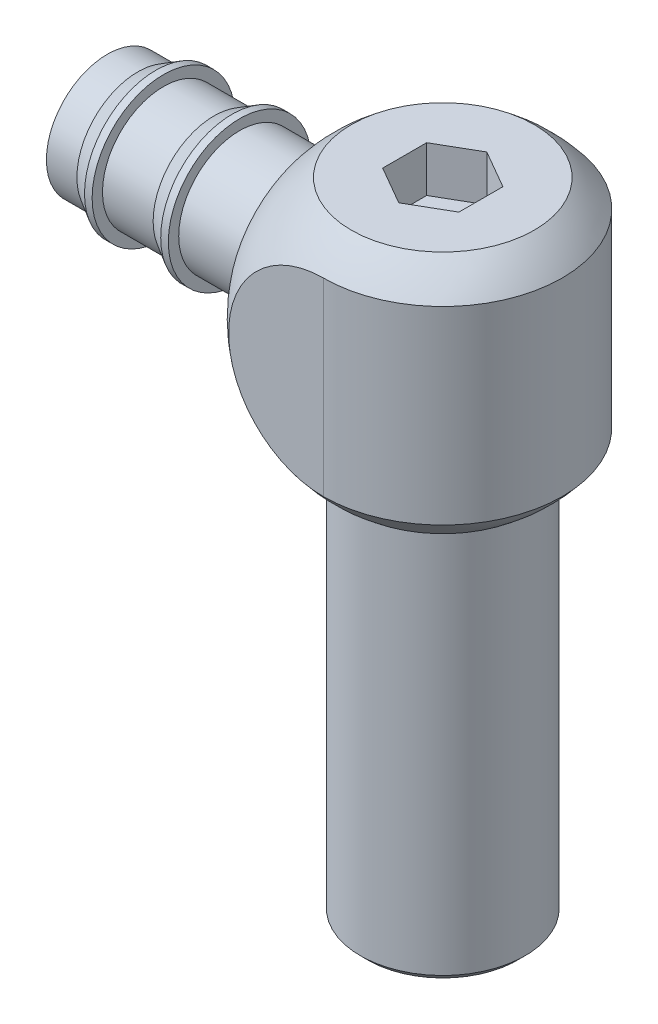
ISO-10303-21;
HEADER;
FILE_DESCRIPTION(('STEP AP214'),'2;1');
FILE_NAME('part.step','',(''),(''),'','','');
FILE_SCHEMA(('AUTOMOTIVE_DESIGN { 1 0 10303 214 1 1 1 1 }'));
ENDSEC;
DATA;
#1=APPLICATION_CONTEXT('core data for automotive mechanical design processes');
#2=APPLICATION_PROTOCOL_DEFINITION('international standard','automotive_design',2000,#1);
#3=PRODUCT_CONTEXT('',#1,'mechanical');
#4=PRODUCT('Part','Part','',(#3));
#5=PRODUCT_RELATED_PRODUCT_CATEGORY('part','',(#4));
#6=PRODUCT_DEFINITION_FORMATION('','',#4);
#7=PRODUCT_DEFINITION_CONTEXT('part definition',#1,'design');
#8=PRODUCT_DEFINITION('design','',#6,#7);
#9=PRODUCT_DEFINITION_SHAPE('','',#8);
#10=(LENGTH_UNIT() NAMED_UNIT(*) SI_UNIT(.MILLI.,.METRE.));
#11=(NAMED_UNIT(*) PLANE_ANGLE_UNIT() SI_UNIT($,.RADIAN.));
#12=(NAMED_UNIT(*) SI_UNIT($,.STERADIAN.) SOLID_ANGLE_UNIT());
#13=UNCERTAINTY_MEASURE_WITH_UNIT(LENGTH_MEASURE(1.E-05),#10,'distance_accuracy_value','');
#14=(GEOMETRIC_REPRESENTATION_CONTEXT(3) GLOBAL_UNCERTAINTY_ASSIGNED_CONTEXT((#13)) GLOBAL_UNIT_ASSIGNED_CONTEXT((#10,
#11,#12)) REPRESENTATION_CONTEXT('',''));
#15=CARTESIAN_POINT('',(0.,0.,0.));
#16=DIRECTION('',(0.,0.,1.));
#17=DIRECTION('',(1.,0.,0.));
#18=AXIS2_PLACEMENT_3D('',#15,#16,#17);
#19=CARTESIAN_POINT('',(-19.05,5.5626,-12.446));
#20=DIRECTION('',(0.,-1.,0.));
#21=DIRECTION('',(1.,0.,0.));
#22=AXIS2_PLACEMENT_3D('',#19,#20,#21);
#23=PLANE('',#22);
#24=CARTESIAN_POINT('',(0.,5.5626,0.));
#25=DIRECTION('',(0.,-1.,0.));
#26=DIRECTION('',(1.,0.,0.));
#27=AXIS2_PLACEMENT_3D('',#24,#25,#26);
#28=CIRCLE('',#27,9.525);
#29=CARTESIAN_POINT('',(9.525,5.5626,0.));
#30=VERTEX_POINT('',#29);
#31=EDGE_CURVE('E206',#30,#30,#28,.F.);
#32=ORIENTED_EDGE('',*,*,#31,.F.);
#33=EDGE_LOOP('',(#32));
#34=FACE_BOUND('',#33,.T.);
#35=CARTESIAN_POINT('',(0.,5.5626,0.));
#36=DIRECTION('',(0.,1.,0.));
#37=DIRECTION('',(-1.,0.,0.));
#38=AXIS2_PLACEMENT_3D('',#35,#36,#37);
#39=CIRCLE('',#38,8.57249999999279);
#40=CARTESIAN_POINT('',(-8.57249999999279,5.5626,0.));
#41=VERTEX_POINT('',#40);
#42=EDGE_CURVE('E160',#41,#41,#39,.T.);
#43=ORIENTED_EDGE('',*,*,#42,.T.);
#44=EDGE_LOOP('',(#43));
#45=FACE_BOUND('',#44,.T.);
#46=ADVANCED_FACE('F38',(#34,#45),#23,.T.);
#47=CARTESIAN_POINT('',(-12.446,2.3876,12.446));
#48=DIRECTION('',(1.,0.,0.));
#49=DIRECTION('',(0.,0.,-1.));
#50=AXIS2_PLACEMENT_3D('',#47,#48,#49);
#51=PLANE('',#50);
#52=CARTESIAN_POINT('',(-12.446,18.2626,0.));
#53=DIRECTION('',(1.,0.,0.));
#54=DIRECTION('',(0.,0.,-1.));
#55=AXIS2_PLACEMENT_3D('',#52,#53,#54);
#56=CIRCLE('',#55,7.9375);
#57=CARTESIAN_POINT('',(-12.446,18.2626,-7.9375));
#58=VERTEX_POINT('',#57);
#59=EDGE_CURVE('E12',#58,#58,#56,.T.);
#60=ORIENTED_EDGE('',*,*,#59,.T.);
#61=EDGE_LOOP('',(#60));
#62=FACE_BOUND('',#61,.T.);
#63=CARTESIAN_POINT('',(-12.446,18.2626,0.));
#64=DIRECTION('',(1.,0.,0.));
#65=DIRECTION('',(0.,0.,-1.));
#66=AXIS2_PLACEMENT_3D('',#63,#64,#65);
#67=CIRCLE('',#66,9.8545780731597);
#68=CARTESIAN_POINT('',(-12.446,18.2626,-9.8545780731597));
#69=VERTEX_POINT('',#68);
#70=EDGE_CURVE('E214',#69,#69,#67,.F.);
#71=ORIENTED_EDGE('',*,*,#70,.T.);
#72=EDGE_LOOP('',(#71));
#73=FACE_BOUND('',#72,.T.);
#74=ADVANCED_FACE('F250',(#62,#73),#51,.F.);
#75=CARTESIAN_POINT('',(0.,18.2626,0.));
#76=DIRECTION('',(0.,-1.,0.));
#77=DIRECTION('',(1.,0.,0.));
#78=AXIS2_PLACEMENT_3D('',#75,#76,#77);
#79=SPHERICAL_SURFACE('',#78,15.875);
#80=ORIENTED_EDGE('',*,*,#31,.T.);
#81=EDGE_LOOP('',(#80));
#82=FACE_BOUND('',#81,.T.);
#83=ORIENTED_EDGE('',*,*,#70,.F.);
#84=EDGE_LOOP('',(#83));
#85=FACE_BOUND('',#84,.T.);
#86=CARTESIAN_POINT('',(0.,18.2626,-12.446));
#87=DIRECTION('',(0.,0.,1.));
#88=DIRECTION('',(1.,0.,0.));
#89=AXIS2_PLACEMENT_3D('',#86,#87,#88);
#90=CIRCLE('',#89,9.8545780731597);
#91=CARTESIAN_POINT('',(0.,8.40802192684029,-12.446));
#92=VERTEX_POINT('',#91);
#93=CARTESIAN_POINT('',(0.,28.1171780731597,-12.446));
#94=VERTEX_POINT('',#93);
#95=EDGE_CURVE('E222',#92,#94,#90,.F.);
#96=ORIENTED_EDGE('',*,*,#95,.F.);
#97=CARTESIAN_POINT('',(0.,8.40802192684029,0.));
#98=DIRECTION('',(0.,1.,0.));
#99=DIRECTION('',(0.,0.,1.));
#100=AXIS2_PLACEMENT_3D('',#97,#98,#99);
#101=CIRCLE('',#100,12.446);
#102=CARTESIAN_POINT('',(0.,8.40802192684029,12.446));
#103=VERTEX_POINT('',#102);
#104=EDGE_CURVE('E220',#103,#92,#101,.T.);
#105=ORIENTED_EDGE('',*,*,#104,.F.);
#106=CARTESIAN_POINT('',(0.,18.2626,12.446));
#107=DIRECTION('',(0.,0.,-1.));
#108=DIRECTION('',(-1.,0.,0.));
#109=AXIS2_PLACEMENT_3D('',#106,#107,#108);
#110=CIRCLE('',#109,9.8545780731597);
#111=CARTESIAN_POINT('',(0.,28.1171780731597,12.446));
#112=VERTEX_POINT('',#111);
#113=EDGE_CURVE('E215',#112,#103,#110,.F.);
#114=ORIENTED_EDGE('',*,*,#113,.F.);
#115=CARTESIAN_POINT('',(0.,28.1171780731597,0.));
#116=DIRECTION('',(0.,-1.,0.));
#117=DIRECTION('',(0.,0.,-1.));
#118=AXIS2_PLACEMENT_3D('',#115,#116,#117);
#119=CIRCLE('',#118,12.446);
#120=EDGE_CURVE('E217',#94,#112,#119,.T.);
#121=ORIENTED_EDGE('',*,*,#120,.F.);
#122=EDGE_LOOP('',(#96,#105,#114,#121));
#123=FACE_BOUND('',#122,.T.);
#124=CARTESIAN_POINT('',(0.,30.9626,0.));
#125=DIRECTION('',(0.,1.,0.));
#126=DIRECTION('',(-1.,0.,0.));
#127=AXIS2_PLACEMENT_3D('',#124,#125,#126);
#128=CIRCLE('',#127,9.525);
#129=CARTESIAN_POINT('',(-9.525,30.9626,0.));
#130=VERTEX_POINT('',#129);
#131=EDGE_CURVE('E211',#130,#130,#128,.F.);
#132=ORIENTED_EDGE('',*,*,#131,.T.);
#133=EDGE_LOOP('',(#132));
#134=FACE_BOUND('',#133,.T.);
#135=ADVANCED_FACE('F256',(#82,#85,#123,#134),#79,.T.);
#136=CARTESIAN_POINT('',(0.,2.3876,-12.446));
#137=DIRECTION('',(0.,0.,1.));
#138=DIRECTION('',(1.,0.,0.));
#139=AXIS2_PLACEMENT_3D('',#136,#137,#138);
#140=PLANE('',#139);
#141=ORIENTED_EDGE('',*,*,#95,.T.);
#142=DIRECTION('',(0.,-1.,0.));
#143=VECTOR('',#142,1.);
#144=CARTESIAN_POINT('',(0.,2.3876,-12.446));
#145=LINE('',#144,#143);
#146=EDGE_CURVE('E210',#94,#92,#145,.T.);
#147=ORIENTED_EDGE('',*,*,#146,.T.);
#148=EDGE_LOOP('',(#141,#147));
#149=FACE_BOUND('',#148,.T.);
#150=ADVANCED_FACE('F268',(#149),#140,.F.);
#151=CARTESIAN_POINT('',(0.,2.3876,12.446));
#152=DIRECTION('',(0.,0.,-1.));
#153=DIRECTION('',(-1.,0.,0.));
#154=AXIS2_PLACEMENT_3D('',#151,#152,#153);
#155=PLANE('',#154);
#156=ORIENTED_EDGE('',*,*,#113,.T.);
#157=DIRECTION('',(0.,-1.,0.));
#158=VECTOR('',#157,1.);
#159=CARTESIAN_POINT('',(0.,2.3876,12.446));
#160=LINE('',#159,#158);
#161=EDGE_CURVE('E207',#112,#103,#160,.T.);
#162=ORIENTED_EDGE('',*,*,#161,.F.);
#163=EDGE_LOOP('',(#156,#162));
#164=FACE_BOUND('',#163,.T.);
#165=ADVANCED_FACE('F265',(#164),#155,.F.);
#166=CARTESIAN_POINT('',(0.,2.3876,0.));
#167=DIRECTION('',(0.,-1.,0.));
#168=DIRECTION('',(0.,0.,-1.));
#169=AXIS2_PLACEMENT_3D('',#166,#167,#168);
#170=CYLINDRICAL_SURFACE('',#169,12.446);
#171=ORIENTED_EDGE('',*,*,#104,.T.);
#172=ORIENTED_EDGE('',*,*,#146,.F.);
#173=ORIENTED_EDGE('',*,*,#120,.T.);
#174=ORIENTED_EDGE('',*,*,#161,.T.);
#175=EDGE_LOOP('',(#171,#172,#173,#174));
#176=FACE_BOUND('',#175,.T.);
#177=ADVANCED_FACE('F267',(#176),#170,.T.);
#178=CARTESIAN_POINT('',(-19.05,30.9626,-12.446));
#179=DIRECTION('',(0.,1.,0.));
#180=DIRECTION('',(-1.,0.,0.));
#181=AXIS2_PLACEMENT_3D('',#178,#179,#180);
#182=PLANE('',#181);
#183=DIRECTION('',(0.,0.,-1.));
#184=VECTOR('',#183,1.);
#185=CARTESIAN_POINT('',(3.96875000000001,30.9626,2.29135888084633));
#186=LINE('',#185,#184);
#187=CARTESIAN_POINT('',(3.96875000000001,30.9626,2.29135888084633));
#188=VERTEX_POINT('',#187);
#189=CARTESIAN_POINT('',(3.96875000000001,30.9626,-2.29135888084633));
#190=VERTEX_POINT('',#189);
#191=EDGE_CURVE('E59',#188,#190,#186,.T.);
#192=ORIENTED_EDGE('',*,*,#191,.F.);
#193=DIRECTION('',(0.866025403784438,0.,-0.5));
#194=VECTOR('',#193,1.);
#195=CARTESIAN_POINT('',(0.,30.9626,4.58271776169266));
#196=LINE('',#195,#194);
#197=CARTESIAN_POINT('',(0.,30.9626,4.58271776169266));
#198=VERTEX_POINT('',#197);
#199=EDGE_CURVE('E127',#198,#188,#196,.T.);
#200=ORIENTED_EDGE('',*,*,#199,.F.);
#201=DIRECTION('',(0.866025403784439,0.,0.5));
#202=VECTOR('',#201,1.);
#203=CARTESIAN_POINT('',(-3.96875,30.9626,2.29135888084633));
#204=LINE('',#203,#202);
#205=CARTESIAN_POINT('',(-3.96875,30.9626,2.29135888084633));
#206=VERTEX_POINT('',#205);
#207=EDGE_CURVE('E130',#206,#198,#204,.T.);
#208=ORIENTED_EDGE('',*,*,#207,.F.);
#209=DIRECTION('',(0.,0.,1.));
#210=VECTOR('',#209,1.);
#211=CARTESIAN_POINT('',(-3.96875,30.9626,-2.29135888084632));
#212=LINE('',#211,#210);
#213=CARTESIAN_POINT('',(-3.96875,30.9626,-2.29135888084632));
#214=VERTEX_POINT('',#213);
#215=EDGE_CURVE('E153',#214,#206,#212,.T.);
#216=ORIENTED_EDGE('',*,*,#215,.F.);
#217=DIRECTION('',(-0.866025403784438,0.,0.5));
#218=VECTOR('',#217,1.);
#219=CARTESIAN_POINT('',(0.,30.9626,-4.58271776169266));
#220=LINE('',#219,#218);
#221=CARTESIAN_POINT('',(0.,30.9626,-4.58271776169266));
#222=VERTEX_POINT('',#221);
#223=EDGE_CURVE('E150',#222,#214,#220,.T.);
#224=ORIENTED_EDGE('',*,*,#223,.F.);
#225=DIRECTION('',(-0.866025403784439,0.,-0.499999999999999));
#226=VECTOR('',#225,1.);
#227=CARTESIAN_POINT('',(3.96875000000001,30.9626,-2.29135888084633));
#228=LINE('',#227,#226);
#229=EDGE_CURVE('E148',#190,#222,#228,.T.);
#230=ORIENTED_EDGE('',*,*,#229,.F.);
#231=EDGE_LOOP('',(#192,#200,#208,#216,#224,#230));
#232=FACE_BOUND('',#231,.T.);
#233=ORIENTED_EDGE('',*,*,#131,.F.);
#234=EDGE_LOOP('',(#233));
#235=FACE_BOUND('',#234,.T.);
#236=ADVANCED_FACE('F263',(#232,#235),#182,.T.);
#237=CARTESIAN_POINT('',(0.,18.2626,0.));
#238=DIRECTION('',(-1.,0.,0.));
#239=DIRECTION('',(0.,0.,1.));
#240=AXIS2_PLACEMENT_3D('',#237,#238,#239);
#241=CYLINDRICAL_SURFACE('',#240,6.35);
#242=CARTESIAN_POINT('',(-14.0335,18.2626,0.));
#243=DIRECTION('',(1.,0.,0.));
#244=DIRECTION('',(0.,0.,-1.));
#245=AXIS2_PLACEMENT_3D('',#242,#243,#244);
#246=CIRCLE('',#245,6.35);
#247=CARTESIAN_POINT('',(-14.0335,18.2626,-6.35));
#248=VERTEX_POINT('',#247);
#249=EDGE_CURVE('E46',#248,#248,#246,.F.);
#250=ORIENTED_EDGE('',*,*,#249,.T.);
#251=EDGE_LOOP('',(#250));
#252=FACE_BOUND('',#251,.T.);
#253=CARTESIAN_POINT('',(-21.1490011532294,18.2626,0.));
#254=DIRECTION('',(-1.,0.,0.));
#255=DIRECTION('',(0.,0.,1.));
#256=AXIS2_PLACEMENT_3D('',#253,#254,#255);
#257=CIRCLE('',#256,6.35);
#258=CARTESIAN_POINT('',(-21.1490011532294,18.2626,6.35));
#259=VERTEX_POINT('',#258);
#260=EDGE_CURVE('E182',#259,#259,#257,.T.);
#261=ORIENTED_EDGE('',*,*,#260,.F.);
#262=EDGE_LOOP('',(#261));
#263=FACE_BOUND('',#262,.T.);
#264=ADVANCED_FACE('F232',(#252,#263),#241,.T.);
#265=CARTESIAN_POINT('',(0.,18.2626,0.));
#266=DIRECTION('',(-1.,0.,0.));
#267=DIRECTION('',(0.,0.,1.));
#268=AXIS2_PLACEMENT_3D('',#265,#266,#267);
#269=CYLINDRICAL_SURFACE('',#268,6.35);
#270=CARTESIAN_POINT('',(-34.925,18.2626,0.));
#271=DIRECTION('',(-1.,0.,0.));
#272=DIRECTION('',(0.,0.,1.));
#273=AXIS2_PLACEMENT_3D('',#270,#271,#272);
#274=CIRCLE('',#273,6.35);
#275=CARTESIAN_POINT('',(-34.925,18.2626,6.35));
#276=VERTEX_POINT('',#275);
#277=EDGE_CURVE('E179',#276,#276,#274,.T.);
#278=ORIENTED_EDGE('',*,*,#277,.F.);
#279=EDGE_LOOP('',(#278));
#280=FACE_BOUND('',#279,.T.);
#281=CARTESIAN_POINT('',(-31.75,18.2626,0.));
#282=DIRECTION('',(-1.,0.,0.));
#283=DIRECTION('',(0.,0.,1.));
#284=AXIS2_PLACEMENT_3D('',#281,#282,#283);
#285=CIRCLE('',#284,6.35);
#286=CARTESIAN_POINT('',(-31.75,18.2626,6.35));
#287=VERTEX_POINT('',#286);
#288=EDGE_CURVE('E203',#287,#287,#285,.T.);
#289=ORIENTED_EDGE('',*,*,#288,.T.);
#290=EDGE_LOOP('',(#289));
#291=FACE_BOUND('',#290,.T.);
#292=ADVANCED_FACE('F294',(#280,#291),#269,.T.);
#293=CARTESIAN_POINT('',(-29.8802511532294,18.2626,0.));
#294=DIRECTION('',(1.,0.,0.));
#295=DIRECTION('',(0.,0.,-1.));
#296=AXIS2_PLACEMENT_3D('',#293,#294,#295);
#297=CONICAL_SURFACE('',#296,7.4295,0.523598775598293);
#298=ORIENTED_EDGE('',*,*,#288,.F.);
#299=EDGE_LOOP('',(#298));
#300=FACE_BOUND('',#299,.T.);
#301=CARTESIAN_POINT('',(-29.8802511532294,18.2626,0.));
#302=DIRECTION('',(-1.,0.,0.));
#303=DIRECTION('',(0.,0.,1.));
#304=AXIS2_PLACEMENT_3D('',#301,#302,#303);
#305=CIRCLE('',#304,7.4295);
#306=CARTESIAN_POINT('',(-29.8802511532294,18.2626,7.4295));
#307=VERTEX_POINT('',#306);
#308=EDGE_CURVE('E200',#307,#307,#305,.T.);
#309=ORIENTED_EDGE('',*,*,#308,.T.);
#310=EDGE_LOOP('',(#309));
#311=FACE_BOUND('',#310,.T.);
#312=ADVANCED_FACE('F360',(#300,#311),#297,.T.);
#313=CARTESIAN_POINT('',(0.,18.2626,0.));
#314=DIRECTION('',(-1.,0.,0.));
#315=DIRECTION('',(0.,0.,1.));
#316=AXIS2_PLACEMENT_3D('',#313,#314,#315);
#317=CYLINDRICAL_SURFACE('',#316,7.4295);
#318=ORIENTED_EDGE('',*,*,#308,.F.);
#319=EDGE_LOOP('',(#318));
#320=FACE_BOUND('',#319,.T.);
#321=CARTESIAN_POINT('',(-29.0865011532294,18.2626,0.));
#322=DIRECTION('',(-1.,0.,0.));
#323=DIRECTION('',(0.,0.,1.));
#324=AXIS2_PLACEMENT_3D('',#321,#322,#323);
#325=CIRCLE('',#324,7.4295);
#326=CARTESIAN_POINT('',(-29.0865011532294,18.2626,7.4295));
#327=VERTEX_POINT('',#326);
#328=EDGE_CURVE('E197',#327,#327,#325,.T.);
#329=ORIENTED_EDGE('',*,*,#328,.T.);
#330=EDGE_LOOP('',(#329));
#331=FACE_BOUND('',#330,.T.);
#332=ADVANCED_FACE('F356',(#320,#331),#317,.T.);
#333=CARTESIAN_POINT('',(-29.0865011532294,18.2626,-7.4295));
#334=DIRECTION('',(-1.,0.,0.));
#335=DIRECTION('',(0.,0.,1.));
#336=AXIS2_PLACEMENT_3D('',#333,#334,#335);
#337=PLANE('',#336);
#338=ORIENTED_EDGE('',*,*,#328,.F.);
#339=EDGE_LOOP('',(#338));
#340=FACE_BOUND('',#339,.T.);
#341=CARTESIAN_POINT('',(-29.0865011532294,18.2626,0.));
#342=DIRECTION('',(-1.,0.,0.));
#343=DIRECTION('',(0.,0.,1.));
#344=AXIS2_PLACEMENT_3D('',#341,#342,#343);
#345=CIRCLE('',#344,6.35);
#346=CARTESIAN_POINT('',(-29.0865011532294,18.2626,6.35));
#347=VERTEX_POINT('',#346);
#348=EDGE_CURVE('E194',#347,#347,#345,.T.);
#349=ORIENTED_EDGE('',*,*,#348,.T.);
#350=EDGE_LOOP('',(#349));
#351=FACE_BOUND('',#350,.T.);
#352=ADVANCED_FACE('F352',(#340,#351),#337,.F.);
#353=CARTESIAN_POINT('',(0.,18.2626,0.));
#354=DIRECTION('',(-1.,0.,0.));
#355=DIRECTION('',(0.,0.,1.));
#356=AXIS2_PLACEMENT_3D('',#353,#354,#355);
#357=CYLINDRICAL_SURFACE('',#356,6.35);
#358=ORIENTED_EDGE('',*,*,#348,.F.);
#359=EDGE_LOOP('',(#358));
#360=FACE_BOUND('',#359,.T.);
#361=CARTESIAN_POINT('',(-23.8125,18.2626,0.));
#362=DIRECTION('',(-1.,0.,0.));
#363=DIRECTION('',(0.,0.,1.));
#364=AXIS2_PLACEMENT_3D('',#361,#362,#363);
#365=CIRCLE('',#364,6.35);
#366=CARTESIAN_POINT('',(-23.8125,18.2626,6.35));
#367=VERTEX_POINT('',#366);
#368=EDGE_CURVE('E191',#367,#367,#365,.T.);
#369=ORIENTED_EDGE('',*,*,#368,.T.);
#370=EDGE_LOOP('',(#369));
#371=FACE_BOUND('',#370,.T.);
#372=ADVANCED_FACE('F348',(#360,#371),#357,.T.);
#373=CARTESIAN_POINT('',(-21.9427511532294,18.2626,0.));
#374=DIRECTION('',(1.,0.,0.));
#375=DIRECTION('',(0.,0.,-1.));
#376=AXIS2_PLACEMENT_3D('',#373,#374,#375);
#377=CONICAL_SURFACE('',#376,7.4295,0.523598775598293);
#378=ORIENTED_EDGE('',*,*,#368,.F.);
#379=EDGE_LOOP('',(#378));
#380=FACE_BOUND('',#379,.T.);
#381=CARTESIAN_POINT('',(-21.9427511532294,18.2626,0.));
#382=DIRECTION('',(-1.,0.,0.));
#383=DIRECTION('',(0.,0.,1.));
#384=AXIS2_PLACEMENT_3D('',#381,#382,#383);
#385=CIRCLE('',#384,7.4295);
#386=CARTESIAN_POINT('',(-21.9427511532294,18.2626,7.4295));
#387=VERTEX_POINT('',#386);
#388=EDGE_CURVE('E188',#387,#387,#385,.T.);
#389=ORIENTED_EDGE('',*,*,#388,.T.);
#390=EDGE_LOOP('',(#389));
#391=FACE_BOUND('',#390,.T.);
#392=ADVANCED_FACE('F344',(#380,#391),#377,.T.);
#393=CARTESIAN_POINT('',(0.,18.2626,0.));
#394=DIRECTION('',(-1.,0.,0.));
#395=DIRECTION('',(0.,0.,1.));
#396=AXIS2_PLACEMENT_3D('',#393,#394,#395);
#397=CYLINDRICAL_SURFACE('',#396,7.4295);
#398=ORIENTED_EDGE('',*,*,#388,.F.);
#399=EDGE_LOOP('',(#398));
#400=FACE_BOUND('',#399,.T.);
#401=CARTESIAN_POINT('',(-21.1490011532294,18.2626,0.));
#402=DIRECTION('',(-1.,0.,0.));
#403=DIRECTION('',(0.,0.,1.));
#404=AXIS2_PLACEMENT_3D('',#401,#402,#403);
#405=CIRCLE('',#404,7.4295);
#406=CARTESIAN_POINT('',(-21.1490011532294,18.2626,7.4295));
#407=VERTEX_POINT('',#406);
#408=EDGE_CURVE('E185',#407,#407,#405,.T.);
#409=ORIENTED_EDGE('',*,*,#408,.T.);
#410=EDGE_LOOP('',(#409));
#411=FACE_BOUND('',#410,.T.);
#412=ADVANCED_FACE('F340',(#400,#411),#397,.T.);
#413=CARTESIAN_POINT('',(-21.1490011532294,18.2626,-7.4295));
#414=DIRECTION('',(-1.,0.,0.));
#415=DIRECTION('',(0.,0.,1.));
#416=AXIS2_PLACEMENT_3D('',#413,#414,#415);
#417=PLANE('',#416);
#418=ORIENTED_EDGE('',*,*,#408,.F.);
#419=EDGE_LOOP('',(#418));
#420=FACE_BOUND('',#419,.T.);
#421=ORIENTED_EDGE('',*,*,#260,.T.);
#422=EDGE_LOOP('',(#421));
#423=FACE_BOUND('',#422,.T.);
#424=ADVANCED_FACE('F245',(#420,#423),#417,.F.);
#425=CARTESIAN_POINT('',(-34.925,18.2626,0.));
#426=DIRECTION('',(1.,0.,0.));
#427=DIRECTION('',(0.,0.,-1.));
#428=AXIS2_PLACEMENT_3D('',#425,#426,#427);
#429=PLANE('',#428);
#430=CARTESIAN_POINT('',(-34.925,18.2626,0.));
#431=DIRECTION('',(-1.,0.,0.));
#432=DIRECTION('',(0.,0.,1.));
#433=AXIS2_PLACEMENT_3D('',#430,#431,#432);
#434=CIRCLE('',#433,5.08);
#435=CARTESIAN_POINT('',(-34.925,18.2626,5.08));
#436=VERTEX_POINT('',#435);
#437=EDGE_CURVE('E176',#436,#436,#434,.T.);
#438=ORIENTED_EDGE('',*,*,#437,.F.);
#439=EDGE_LOOP('',(#438));
#440=FACE_BOUND('',#439,.T.);
#441=ORIENTED_EDGE('',*,*,#277,.T.);
#442=EDGE_LOOP('',(#441));
#443=FACE_BOUND('',#442,.T.);
#444=ADVANCED_FACE('F237',(#440,#443),#429,.F.);
#445=CARTESIAN_POINT('',(-14.0335,18.2626,0.));
#446=DIRECTION('',(1.,0.,0.));
#447=DIRECTION('',(0.,0.,-1.));
#448=AXIS2_PLACEMENT_3D('',#445,#446,#447);
#449=TOROIDAL_SURFACE('',#448,7.9375,1.5875);
#450=ORIENTED_EDGE('',*,*,#59,.F.);
#451=EDGE_LOOP('',(#450));
#452=FACE_BOUND('',#451,.T.);
#453=ORIENTED_EDGE('',*,*,#249,.F.);
#454=EDGE_LOOP('',(#453));
#455=FACE_BOUND('',#454,.T.);
#456=ADVANCED_FACE('F40',(#452,#455),#449,.F.);
#457=CARTESIAN_POINT('',(14.3684097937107,18.2626,0.));
#458=DIRECTION('',(-1.,0.,0.));
#459=DIRECTION('',(0.,0.,1.));
#460=AXIS2_PLACEMENT_3D('',#457,#458,#459);
#461=CYLINDRICAL_SURFACE('',#460,5.08);
#462=CARTESIAN_POINT('',(-2.25066969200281,18.2626,5.08));
#463=CARTESIAN_POINT('',(-2.25065231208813,18.1899018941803,5.08000460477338));
#464=CARTESIAN_POINT('',(-2.25420953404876,18.1172390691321,5.07843544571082));
#465=CARTESIAN_POINT('',(-2.26812549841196,17.9726933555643,5.07223655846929));
#466=CARTESIAN_POINT('',(-2.27848570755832,17.9008106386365,5.06760617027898));
#467=CARTESIAN_POINT('',(-2.31892187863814,17.6868397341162,5.04929680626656));
#468=CARTESIAN_POINT('',(-2.35834723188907,17.54685632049,5.03120101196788));
#469=CARTESIAN_POINT('',(-2.44257486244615,17.3087001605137,4.99072451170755));
#470=CARTESIAN_POINT('',(-2.48365894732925,17.2087237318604,4.97049809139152));
#471=CARTESIAN_POINT('',(-2.57279944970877,17.0130624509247,4.92494958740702));
#472=CARTESIAN_POINT('',(-2.62086075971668,16.9173806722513,4.89962392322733));
#473=CARTESIAN_POINT('',(-2.72191918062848,16.7297572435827,4.84421304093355));
#474=CARTESIAN_POINT('',(-2.77493040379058,16.6378274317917,4.81411403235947));
#475=CARTESIAN_POINT('',(-2.88421161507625,16.4575282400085,4.74945056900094));
#476=CARTESIAN_POINT('',(-2.94048268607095,16.3691600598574,4.71488462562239));
#477=CARTESIAN_POINT('',(-3.10075532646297,16.1264888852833,4.61217251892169));
#478=CARTESIAN_POINT('',(-3.20707285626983,15.9757348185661,4.53920996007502));
#479=CARTESIAN_POINT('',(-3.42185799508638,15.6831865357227,4.379586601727));
#480=CARTESIAN_POINT('',(-3.53032703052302,15.5413985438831,4.2929164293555));
#481=CARTESIAN_POINT('',(-3.74622025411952,15.2666269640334,4.10586419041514));
#482=CARTESIAN_POINT('',(-3.85364552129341,15.1336332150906,4.00549837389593));
#483=CARTESIAN_POINT('',(-4.06505003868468,14.8766851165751,3.79077745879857));
#484=CARTESIAN_POINT('',(-4.16903108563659,14.7527260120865,3.6764298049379));
#485=CARTESIAN_POINT('',(-4.42189237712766,14.4551711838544,3.37267575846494));
#486=CARTESIAN_POINT('',(-4.5673223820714,14.2876268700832,3.17426357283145));
#487=CARTESIAN_POINT('',(-4.83747764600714,13.9799580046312,2.74497565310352));
#488=CARTESIAN_POINT('',(-4.9622389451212,13.8397856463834,2.51415775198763));
#489=CARTESIAN_POINT('',(-5.16031205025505,13.6187662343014,2.07110165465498));
#490=CARTESIAN_POINT('',(-5.238924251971,13.5316589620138,1.86442813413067));
#491=CARTESIAN_POINT('',(-5.33913101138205,13.4210046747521,1.54217514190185));
#492=CARTESIAN_POINT('',(-5.36958739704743,13.3874477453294,1.43268459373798));
#493=CARTESIAN_POINT('',(-5.4240570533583,13.3275175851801,1.21021074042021));
#494=CARTESIAN_POINT('',(-5.44807312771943,13.3011412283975,1.09722897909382));
#495=CARTESIAN_POINT('',(-5.48932161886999,13.2558820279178,0.867727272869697));
#496=CARTESIAN_POINT('',(-5.50650673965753,13.2370514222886,0.751188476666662));
#497=CARTESIAN_POINT('',(-5.53347988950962,13.2075112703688,0.516230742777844));
#498=CARTESIAN_POINT('',(-5.54326789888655,13.1968017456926,0.397811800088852));
#499=CARTESIAN_POINT('',(-5.55521469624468,13.1837316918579,0.16016700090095));
#500=CARTESIAN_POINT('',(-5.55737595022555,13.1813684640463,0.0409414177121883));
#501=CARTESIAN_POINT('',(-5.55402446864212,13.1850342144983,-0.197264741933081));
#502=CARTESIAN_POINT('',(-5.54851233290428,13.1910625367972,-0.316245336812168));
#503=CARTESIAN_POINT('',(-5.53092027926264,13.210315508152,-0.540483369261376));
#504=CARTESIAN_POINT('',(-5.51958966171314,13.2227192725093,-0.64587156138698));
#505=CARTESIAN_POINT('',(-5.49110125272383,13.2539356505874,-0.854908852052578));
#506=CARTESIAN_POINT('',(-5.47394155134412,13.2727503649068,-0.958557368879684));
#507=CARTESIAN_POINT('',(-5.41414626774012,13.3383944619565,-1.26584328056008));
#508=CARTESIAN_POINT('',(-5.36317971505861,13.3944398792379,-1.46600080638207));
#509=CARTESIAN_POINT('',(-5.23937804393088,13.5311675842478,-1.86168961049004));
#510=CARTESIAN_POINT('',(-5.1656346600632,13.6128760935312,-2.05657083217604));
#511=CARTESIAN_POINT('',(-5.00133155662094,13.7961215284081,-2.42901210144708));
#512=CARTESIAN_POINT('',(-4.91076493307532,13.8976665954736,-2.60656499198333));
#513=CARTESIAN_POINT('',(-4.66542973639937,14.1751802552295,-3.03210005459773));
#514=CARTESIAN_POINT('',(-4.50195775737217,14.3621909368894,-3.26796893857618));
#515=CARTESIAN_POINT('',(-4.24332036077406,14.6649656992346,-3.58960480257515));
#516=CARTESIAN_POINT('',(-4.1546717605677,14.7698411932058,-3.69163348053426));
#517=CARTESIAN_POINT('',(-3.97428355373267,14.9864698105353,-3.88515619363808));
#518=CARTESIAN_POINT('',(-3.88254455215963,15.0982215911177,-3.97665227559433));
#519=CARTESIAN_POINT('',(-3.69521787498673,15.3310428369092,-4.15139687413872));
#520=CARTESIAN_POINT('',(-3.5995910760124,15.4522741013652,-4.23438642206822));
#521=CARTESIAN_POINT('',(-3.40847458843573,15.7016199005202,-4.38968870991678));
#522=CARTESIAN_POINT('',(-3.31298498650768,15.8297376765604,-4.46199636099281));
#523=CARTESIAN_POINT('',(-3.1248377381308,16.0929081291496,-4.59571278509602));
#524=CARTESIAN_POINT('',(-3.03217294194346,16.2279404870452,-4.65715136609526));
#525=CARTESIAN_POINT('',(-2.8529046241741,16.506206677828,-4.76906305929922));
#526=CARTESIAN_POINT('',(-2.76629444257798,16.6494311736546,-4.81954835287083));
#527=CARTESIAN_POINT('',(-2.61669125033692,16.9236800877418,-4.90214433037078));
#528=CARTESIAN_POINT('',(-2.5521031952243,17.0533278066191,-4.93587360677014));
#529=CARTESIAN_POINT('',(-2.43684265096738,17.320703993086,-4.99378276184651));
#530=CARTESIAN_POINT('',(-2.38614375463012,17.4584165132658,-5.01798080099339));
#531=CARTESIAN_POINT('',(-2.31298103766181,17.7176064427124,-5.05206999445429));
#532=CARTESIAN_POINT('',(-2.28718708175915,17.8378767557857,-5.06369143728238));
#533=CARTESIAN_POINT('',(-2.25474759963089,18.0814232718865,-5.07822581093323));
#534=CARTESIAN_POINT('',(-2.24806603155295,18.2046933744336,-5.08115513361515));
#535=CARTESIAN_POINT('',(-2.25515229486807,18.4505800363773,-5.0780122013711));
#536=CARTESIAN_POINT('',(-2.2689359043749,18.5731960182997,-5.07193300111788));
#537=CARTESIAN_POINT('',(-2.31428214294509,18.8144608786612,-5.05139492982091));
#538=CARTESIAN_POINT('',(-2.34588389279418,18.9331004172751,-5.0369176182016));
#539=CARTESIAN_POINT('',(-2.41571981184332,19.1448875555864,-5.00374181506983));
#540=CARTESIAN_POINT('',(-2.45189807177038,19.2389271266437,-4.9861872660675));
#541=CARTESIAN_POINT('',(-2.53092862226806,19.4232112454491,-4.94654118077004));
#542=CARTESIAN_POINT('',(-2.57378606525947,19.5134527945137,-4.9244461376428));
#543=CARTESIAN_POINT('',(-2.66439995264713,19.6906530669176,-4.87601627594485));
#544=CARTESIAN_POINT('',(-2.71217336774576,19.7775988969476,-4.8496665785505));
#545=CARTESIAN_POINT('',(-2.81107178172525,19.9482542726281,-4.79302076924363));
#546=CARTESIAN_POINT('',(-2.86219801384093,20.0319626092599,-4.76272320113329));
#547=CARTESIAN_POINT('',(-3.01322494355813,20.2697222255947,-4.66966758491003));
#548=CARTESIAN_POINT('',(-3.11602063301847,20.4200413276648,-4.60202715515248));
#549=CARTESIAN_POINT('',(-3.32474690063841,20.7118310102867,-4.45358822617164));
#550=CARTESIAN_POINT('',(-3.43067983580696,20.8532946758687,-4.3727796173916));
#551=CARTESIAN_POINT('',(-3.64242205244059,21.1277933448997,-4.19803632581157));
#552=CARTESIAN_POINT('',(-3.74823136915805,21.2608339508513,-4.10411050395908));
#553=CARTESIAN_POINT('',(-3.95731360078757,21.5184340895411,-3.90290098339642));
#554=CARTESIAN_POINT('',(-4.0605877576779,21.6429978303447,-3.79562398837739));
#555=CARTESIAN_POINT('',(-4.24153483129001,21.8581158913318,-3.59108162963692));
#556=CARTESIAN_POINT('',(-4.32007132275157,21.950361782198,-3.49636196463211));
#557=CARTESIAN_POINT('',(-4.47318008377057,22.1285931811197,-3.29822308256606));
#558=CARTESIAN_POINT('',(-4.54775143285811,22.2145772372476,-3.1948018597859));
#559=CARTESIAN_POINT('',(-4.76360727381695,22.4617569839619,-2.87172955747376));
#560=CARTESIAN_POINT('',(-4.89748474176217,22.6127099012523,-2.63877452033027));
#561=CARTESIAN_POINT('',(-5.10959941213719,22.8500437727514,-2.19336109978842));
#562=CARTESIAN_POINT('',(-5.19360802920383,22.9433291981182,-1.98736913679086));
#563=CARTESIAN_POINT('',(-5.30208400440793,23.0633155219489,-1.6651450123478));
#564=CARTESIAN_POINT('',(-5.33532698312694,23.099995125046,-1.55549698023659));
#565=CARTESIAN_POINT('',(-5.39537516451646,23.1661448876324,-1.33235476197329));
#566=CARTESIAN_POINT('',(-5.42218320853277,23.1956182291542,-1.21886229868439));
#567=CARTESIAN_POINT('',(-5.46900493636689,23.2470372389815,-0.987872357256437));
#568=CARTESIAN_POINT('',(-5.48896608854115,23.268924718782,-0.870351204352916));
#569=CARTESIAN_POINT('',(-5.52136955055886,23.3044310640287,-0.633033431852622));
#570=CARTESIAN_POINT('',(-5.533811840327,23.3180499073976,-0.513236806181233));
#571=CARTESIAN_POINT('',(-5.55087649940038,23.3367235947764,-0.272473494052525));
#572=CARTESIAN_POINT('',(-5.55550227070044,23.3417821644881,-0.151507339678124));
#573=CARTESIAN_POINT('',(-5.55683033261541,23.3432347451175,0.0905125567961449));
#574=CARTESIAN_POINT('',(-5.5535333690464,23.339629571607,0.211566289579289));
#575=CARTESIAN_POINT('',(-5.53992709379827,23.324742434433,0.438805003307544));
#576=CARTESIAN_POINT('',(-5.53046523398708,23.3143881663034,0.545103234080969));
#577=CARTESIAN_POINT('',(-5.50558294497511,23.2871357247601,0.756164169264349));
#578=CARTESIAN_POINT('',(-5.4901605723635,23.270235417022,0.860926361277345));
#579=CARTESIAN_POINT('',(-5.43534254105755,23.210095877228,1.17179768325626));
#580=CARTESIAN_POINT('',(-5.38738371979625,23.1574047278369,1.37468483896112));
#581=CARTESIAN_POINT('',(-5.26986084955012,23.0277541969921,1.77346452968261));
#582=CARTESIAN_POINT('',(-5.19965286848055,22.9500702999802,1.96892367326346));
#583=CARTESIAN_POINT('',(-5.04211698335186,22.7746836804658,2.34312996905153));
#584=CARTESIAN_POINT('',(-4.95478103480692,22.6769715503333,2.52186920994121));
#585=CARTESIAN_POINT('',(-4.71845670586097,22.4103651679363,2.94859273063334));
#586=CARTESIAN_POINT('',(-4.56081015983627,22.2306541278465,3.18512067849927));
#587=CARTESIAN_POINT('',(-4.31038868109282,21.939063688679,3.50873801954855));
#588=CARTESIAN_POINT('',(-4.22442120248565,21.837993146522,3.61157246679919));
#589=CARTESIAN_POINT('',(-4.04913300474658,21.6290828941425,3.80704984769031));
#590=CARTESIAN_POINT('',(-3.95981283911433,21.5212442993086,3.89969445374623));
#591=CARTESIAN_POINT('',(-3.77708390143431,21.2966115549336,4.0770275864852));
#592=CARTESIAN_POINT('',(-3.68362842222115,21.1796651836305,4.1614737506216));
#593=CARTESIAN_POINT('',(-3.49629548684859,20.9392143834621,4.32005611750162));
#594=CARTESIAN_POINT('',(-3.4024178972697,20.815707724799,4.39418878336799));
#595=CARTESIAN_POINT('',(-3.21647389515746,20.5620866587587,4.53206058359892));
#596=CARTESIAN_POINT('',(-3.12440474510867,20.4319835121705,4.59581669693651));
#597=CARTESIAN_POINT('',(-2.94481660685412,20.1642595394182,4.71290010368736));
#598=CARTESIAN_POINT('',(-2.85729407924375,20.0266447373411,4.76623560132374));
#599=CARTESIAN_POINT('',(-2.69354049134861,19.7465879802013,4.86059673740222));
#600=CARTESIAN_POINT('',(-2.61705412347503,19.6044047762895,4.90193667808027));
#601=CARTESIAN_POINT('',(-2.47912442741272,19.3101423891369,4.97311372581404));
#602=CARTESIAN_POINT('',(-2.41764993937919,19.1580845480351,5.00297473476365));
#603=CARTESIAN_POINT('',(-2.33167186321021,18.8821629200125,5.04350452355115));
#604=CARTESIAN_POINT('',(-2.30180974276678,18.7604567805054,5.05707679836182));
#605=CARTESIAN_POINT('',(-2.2613502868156,18.5133246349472,5.07530823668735));
#606=CARTESIAN_POINT('',(-2.25069964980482,18.3879099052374,5.0799920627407));
#607=CARTESIAN_POINT('',(-2.25066969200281,18.2626,5.08));
#608=B_SPLINE_CURVE_WITH_KNOTS('',3,(#462,#463,#464,#465,#466,#467,#468,#469,#470,#471,#472,
#473,#474,#475,#476,#477,#478,#479,#480,#481,#482,#483,#484,#485,#486,#487,#488,#489,#490,#491,
#492,#493,#494,#495,#496,#497,#498,#499,#500,#501,#502,#503,#504,#505,#506,#507,#508,#509,#510,
#511,#512,#513,#514,#515,#516,#517,#518,#519,#520,#521,#522,#523,#524,#525,#526,#527,#528,#529,
#530,#531,#532,#533,#534,#535,#536,#537,#538,#539,#540,#541,#542,#543,#544,#545,#546,#547,#548,
#549,#550,#551,#552,#553,#554,#555,#556,#557,#558,#559,#560,#561,#562,#563,#564,#565,#566,#567,
#568,#569,#570,#571,#572,#573,#574,#575,#576,#577,#578,#579,#580,#581,#582,#583,#584,#585,#586,
#587,#588,#589,#590,#591,#592,#593,#594,#595,#596,#597,#598,#599,#600,#601,#602,#603,#604,#605,
#606,#607),.UNSPECIFIED.,.T.,.F.,(4,2,2,2,2,2,2,2,2,2,2,2,2,2,2,2,2,2,2,2,2,2,2,2,2,2,2,2,2,2,2,
2,2,2,2,2,2,2,2,2,2,2,2,2,2,2,2,2,2,2,2,2,2,2,2,2,2,2,2,2,2,2,2,2,2,2,2,2,2,2,2,2,4),(0.,
0.217928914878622,0.43590483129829,0.873116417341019,1.20260456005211,1.53232486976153,
1.8630157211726,2.19381705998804,2.78812001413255,3.38283110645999,3.97684260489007,
4.57053918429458,5.46012243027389,6.3481377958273,7.05797447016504,7.41309209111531,
7.76805486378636,8.12543421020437,8.48281450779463,8.84007924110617,9.19731604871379,
9.51709331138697,9.83697545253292,10.4762029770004,11.14521354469,11.8144992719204,
12.8360274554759,13.3489234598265,13.861719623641,14.387159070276,14.9128480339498,
15.4370721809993,15.9607103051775,16.4060729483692,16.8505828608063,17.2197128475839,
17.5881462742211,17.9568639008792,18.3263942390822,18.6327836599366,18.939410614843,
19.2471340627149,19.5549713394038,20.1369090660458,20.7192956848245,21.3012907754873,
21.8829948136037,22.3439250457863,22.8049618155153,23.7244992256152,24.4451305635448,
24.8056568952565,25.1660237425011,25.5290966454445,25.8921705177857,26.2550863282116,
26.6179679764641,26.939238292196,27.2606134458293,27.902788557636,28.5655713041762,
29.2286660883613,30.2315820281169,30.7348658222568,31.2380668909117,31.7532657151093,
32.2686407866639,32.7831638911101,33.2972802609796,33.7963659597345,34.2944067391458,
34.6710980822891,35.0467426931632),.UNSPECIFIED.);
#609=CARTESIAN_POINT('',(-5.55625000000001,23.3426,0.));
#610=VERTEX_POINT('',#609);
#611=EDGE_CURVE('E133',#610,#610,#608,.T.);
#612=ORIENTED_EDGE('',*,*,#611,.T.);
#613=EDGE_LOOP('',(#612));
#614=FACE_BOUND('',#613,.T.);
#615=ORIENTED_EDGE('',*,*,#437,.T.);
#616=EDGE_LOOP('',(#615));
#617=FACE_BOUND('',#616,.T.);
#618=ADVANCED_FACE('F236',(#614,#617),#461,.F.);
#619=CARTESIAN_POINT('',(0.,-35.7124,0.));
#620=DIRECTION('',(0.,1.,0.));
#621=DIRECTION('',(-1.,0.,0.));
#622=AXIS2_PLACEMENT_3D('',#619,#620,#621);
#623=CONICAL_SURFACE('',#622,7.81049999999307,0.785398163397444);
#624=CARTESIAN_POINT('',(0.,-34.9504,0.));
#625=DIRECTION('',(0.,1.,0.));
#626=DIRECTION('',(-1.,0.,0.));
#627=AXIS2_PLACEMENT_3D('',#624,#625,#626);
#628=CIRCLE('',#627,8.57249999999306);
#629=CARTESIAN_POINT('',(-8.57249999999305,-34.9504,0.));
#630=VERTEX_POINT('',#629);
#631=EDGE_CURVE('E173',#630,#630,#628,.T.);
#632=ORIENTED_EDGE('',*,*,#631,.F.);
#633=EDGE_LOOP('',(#632));
#634=FACE_BOUND('',#633,.T.);
#635=CARTESIAN_POINT('',(0.,-35.7124,0.));
#636=DIRECTION('',(0.,1.,0.));
#637=DIRECTION('',(-1.,0.,0.));
#638=AXIS2_PLACEMENT_3D('',#635,#636,#637);
#639=CIRCLE('',#638,7.81049999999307);
#640=CARTESIAN_POINT('',(-7.81049999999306,-35.7124,0.));
#641=VERTEX_POINT('',#640);
#642=EDGE_CURVE('E170',#641,#641,#639,.T.);
#643=ORIENTED_EDGE('',*,*,#642,.T.);
#644=EDGE_LOOP('',(#643));
#645=FACE_BOUND('',#644,.T.);
#646=ADVANCED_FACE('F243',(#634,#645),#623,.T.);
#647=CARTESIAN_POINT('',(0.,-35.7124,0.));
#648=DIRECTION('',(0.,1.,0.));
#649=DIRECTION('',(-1.,0.,0.));
#650=AXIS2_PLACEMENT_3D('',#647,#648,#649);
#651=PLANE('',#650);
#652=CARTESIAN_POINT('',(0.,-35.7124,0.));
#653=DIRECTION('',(0.,-1.,0.));
#654=DIRECTION('',(1.,0.,0.));
#655=AXIS2_PLACEMENT_3D('',#652,#653,#654);
#656=CIRCLE('',#655,5.55625);
#657=CARTESIAN_POINT('',(5.55625,-35.7124,0.));
#658=VERTEX_POINT('',#657);
#659=EDGE_CURVE('E603',#658,#658,#656,.T.);
#660=ORIENTED_EDGE('',*,*,#659,.F.);
#661=EDGE_LOOP('',(#660));
#662=FACE_BOUND('',#661,.T.);
#663=ORIENTED_EDGE('',*,*,#642,.F.);
#664=EDGE_LOOP('',(#663));
#665=FACE_BOUND('',#664,.T.);
#666=ADVANCED_FACE('F329',(#662,#665),#651,.F.);
#667=CARTESIAN_POINT('',(0.,-10.6033932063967,0.));
#668=DIRECTION('',(0.,1.,0.));
#669=DIRECTION('',(-1.,0.,0.));
#670=AXIS2_PLACEMENT_3D('',#667,#668,#669);
#671=CYLINDRICAL_SURFACE('',#670,8.57249999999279);
#672=ORIENTED_EDGE('',*,*,#42,.F.);
#673=EDGE_LOOP('',(#672));
#674=FACE_BOUND('',#673,.T.);
#675=ORIENTED_EDGE('',*,*,#631,.T.);
#676=EDGE_LOOP('',(#675));
#677=FACE_BOUND('',#676,.T.);
#678=ADVANCED_FACE('F317',(#674,#677),#671,.T.);
#679=CARTESIAN_POINT('',(3.96875000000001,26.2001,2.29135888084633));
#680=DIRECTION('',(1.,0.,0.));
#681=DIRECTION('',(0.,0.,-1.));
#682=AXIS2_PLACEMENT_3D('',#679,#680,#681);
#683=PLANE('',#682);
#684=ORIENTED_EDGE('',*,*,#191,.T.);
#685=DIRECTION('',(0.,1.,0.));
#686=VECTOR('',#685,1.);
#687=CARTESIAN_POINT('',(3.96875000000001,26.2001,-2.29135888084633));
#688=LINE('',#687,#686);
#689=CARTESIAN_POINT('',(3.96875000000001,26.2001,-2.29135888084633));
#690=VERTEX_POINT('',#689);
#691=EDGE_CURVE('E104',#690,#190,#688,.T.);
#692=ORIENTED_EDGE('',*,*,#691,.F.);
#693=DIRECTION('',(0.,0.,-1.));
#694=VECTOR('',#693,1.);
#695=CARTESIAN_POINT('',(3.96875000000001,26.2001,2.29135888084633));
#696=LINE('',#695,#694);
#697=CARTESIAN_POINT('',(3.96875000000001,26.2001,2.29135888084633));
#698=VERTEX_POINT('',#697);
#699=EDGE_CURVE('E108',#698,#690,#696,.T.);
#700=ORIENTED_EDGE('',*,*,#699,.F.);
#701=DIRECTION('',(0.,1.,0.));
#702=VECTOR('',#701,1.);
#703=CARTESIAN_POINT('',(3.96875000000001,26.2001,2.29135888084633));
#704=LINE('',#703,#702);
#705=EDGE_CURVE('E158',#698,#188,#704,.T.);
#706=ORIENTED_EDGE('',*,*,#705,.T.);
#707=EDGE_LOOP('',(#684,#692,#700,#706));
#708=FACE_BOUND('',#707,.T.);
#709=ADVANCED_FACE('F106',(#708),#683,.F.);
#710=CARTESIAN_POINT('',(0.,26.2001,4.58271776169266));
#711=DIRECTION('',(0.5,0.,0.866025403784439));
#712=DIRECTION('',(0.866025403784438,0.,-0.5));
#713=AXIS2_PLACEMENT_3D('',#710,#711,#712);
#714=PLANE('',#713);
#715=ORIENTED_EDGE('',*,*,#199,.T.);
#716=ORIENTED_EDGE('',*,*,#705,.F.);
#717=DIRECTION('',(0.866025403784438,0.,-0.5));
#718=VECTOR('',#717,1.);
#719=CARTESIAN_POINT('',(0.,26.2001,4.58271776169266));
#720=LINE('',#719,#718);
#721=CARTESIAN_POINT('',(0.,26.2001,4.58271776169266));
#722=VERTEX_POINT('',#721);
#723=EDGE_CURVE('E114',#722,#698,#720,.T.);
#724=ORIENTED_EDGE('',*,*,#723,.F.);
#725=DIRECTION('',(0.,1.,0.));
#726=VECTOR('',#725,1.);
#727=CARTESIAN_POINT('',(0.,26.2001,4.58271776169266));
#728=LINE('',#727,#726);
#729=EDGE_CURVE('E161',#722,#198,#728,.T.);
#730=ORIENTED_EDGE('',*,*,#729,.T.);
#731=EDGE_LOOP('',(#715,#716,#724,#730));
#732=FACE_BOUND('',#731,.T.);
#733=ADVANCED_FACE('F309',(#732),#714,.F.);
#734=CARTESIAN_POINT('',(-3.96875,26.2001,2.29135888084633));
#735=DIRECTION('',(-0.5,0.,0.866025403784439));
#736=DIRECTION('',(0.866025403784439,0.,0.5));
#737=AXIS2_PLACEMENT_3D('',#734,#735,#736);
#738=PLANE('',#737);
#739=ORIENTED_EDGE('',*,*,#207,.T.);
#740=ORIENTED_EDGE('',*,*,#729,.F.);
#741=DIRECTION('',(0.866025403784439,0.,0.5));
#742=VECTOR('',#741,1.);
#743=CARTESIAN_POINT('',(-3.96875,26.2001,2.29135888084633));
#744=LINE('',#743,#742);
#745=CARTESIAN_POINT('',(-3.96875,26.2001,2.29135888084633));
#746=VERTEX_POINT('',#745);
#747=EDGE_CURVE('E144',#746,#722,#744,.T.);
#748=ORIENTED_EDGE('',*,*,#747,.F.);
#749=DIRECTION('',(0.,1.,0.));
#750=VECTOR('',#749,1.);
#751=CARTESIAN_POINT('',(-3.96875,26.2001,2.29135888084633));
#752=LINE('',#751,#750);
#753=EDGE_CURVE('E163',#746,#206,#752,.T.);
#754=ORIENTED_EDGE('',*,*,#753,.T.);
#755=EDGE_LOOP('',(#739,#740,#748,#754));
#756=FACE_BOUND('',#755,.T.);
#757=ADVANCED_FACE('F307',(#756),#738,.F.);
#758=CARTESIAN_POINT('',(-3.96875,26.2001,-2.29135888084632));
#759=DIRECTION('',(-1.,0.,0.));
#760=DIRECTION('',(0.,0.,1.));
#761=AXIS2_PLACEMENT_3D('',#758,#759,#760);
#762=PLANE('',#761);
#763=ORIENTED_EDGE('',*,*,#215,.T.);
#764=ORIENTED_EDGE('',*,*,#753,.F.);
#765=DIRECTION('',(0.,0.,1.));
#766=VECTOR('',#765,1.);
#767=CARTESIAN_POINT('',(-3.96875,26.2001,-2.29135888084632));
#768=LINE('',#767,#766);
#769=CARTESIAN_POINT('',(-3.96875,26.2001,-2.29135888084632));
#770=VERTEX_POINT('',#769);
#771=EDGE_CURVE('E141',#770,#746,#768,.T.);
#772=ORIENTED_EDGE('',*,*,#771,.F.);
#773=DIRECTION('',(0.,1.,0.));
#774=VECTOR('',#773,1.);
#775=CARTESIAN_POINT('',(-3.96875,26.2001,-2.29135888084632));
#776=LINE('',#775,#774);
#777=EDGE_CURVE('E165',#770,#214,#776,.T.);
#778=ORIENTED_EDGE('',*,*,#777,.T.);
#779=EDGE_LOOP('',(#763,#764,#772,#778));
#780=FACE_BOUND('',#779,.T.);
#781=ADVANCED_FACE('F305',(#780),#762,.F.);
#782=CARTESIAN_POINT('',(0.,26.2001,-4.58271776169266));
#783=DIRECTION('',(-0.5,0.,-0.866025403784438));
#784=DIRECTION('',(-0.866025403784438,0.,0.5));
#785=AXIS2_PLACEMENT_3D('',#782,#783,#784);
#786=PLANE('',#785);
#787=ORIENTED_EDGE('',*,*,#223,.T.);
#788=ORIENTED_EDGE('',*,*,#777,.F.);
#789=DIRECTION('',(-0.866025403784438,0.,0.5));
#790=VECTOR('',#789,1.);
#791=CARTESIAN_POINT('',(0.,26.2001,-4.58271776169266));
#792=LINE('',#791,#790);
#793=CARTESIAN_POINT('',(0.,26.2001,-4.58271776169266));
#794=VERTEX_POINT('',#793);
#795=EDGE_CURVE('E122',#794,#770,#792,.T.);
#796=ORIENTED_EDGE('',*,*,#795,.F.);
#797=DIRECTION('',(0.,1.,0.));
#798=VECTOR('',#797,1.);
#799=CARTESIAN_POINT('',(0.,26.2001,-4.58271776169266));
#800=LINE('',#799,#798);
#801=EDGE_CURVE('E113',#794,#222,#800,.T.);
#802=ORIENTED_EDGE('',*,*,#801,.T.);
#803=EDGE_LOOP('',(#787,#788,#796,#802));
#804=FACE_BOUND('',#803,.T.);
#805=ADVANCED_FACE('F301',(#804),#786,.F.);
#806=CARTESIAN_POINT('',(3.96875000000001,26.2001,-2.29135888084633));
#807=DIRECTION('',(0.499999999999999,0.,-0.866025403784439));
#808=DIRECTION('',(-0.866025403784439,0.,-0.5));
#809=AXIS2_PLACEMENT_3D('',#806,#807,#808);
#810=PLANE('',#809);
#811=ORIENTED_EDGE('',*,*,#229,.T.);
#812=ORIENTED_EDGE('',*,*,#801,.F.);
#813=DIRECTION('',(-0.866025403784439,0.,-0.499999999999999));
#814=VECTOR('',#813,1.);
#815=CARTESIAN_POINT('',(3.96875000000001,26.2001,-2.29135888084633));
#816=LINE('',#815,#814);
#817=EDGE_CURVE('E117',#690,#794,#816,.T.);
#818=ORIENTED_EDGE('',*,*,#817,.F.);
#819=ORIENTED_EDGE('',*,*,#691,.T.);
#820=EDGE_LOOP('',(#811,#812,#818,#819));
#821=FACE_BOUND('',#820,.T.);
#822=ADVANCED_FACE('F118',(#821),#810,.F.);
#823=CARTESIAN_POINT('',(3.96875000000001,26.2001,-2.29135888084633));
#824=DIRECTION('',(0.,1.,0.));
#825=DIRECTION('',(0.,0.,1.));
#826=AXIS2_PLACEMENT_3D('',#823,#824,#825);
#827=PLANE('',#826);
#828=ORIENTED_EDGE('',*,*,#699,.T.);
#829=ORIENTED_EDGE('',*,*,#817,.T.);
#830=ORIENTED_EDGE('',*,*,#795,.T.);
#831=ORIENTED_EDGE('',*,*,#771,.T.);
#832=ORIENTED_EDGE('',*,*,#747,.T.);
#833=ORIENTED_EDGE('',*,*,#723,.T.);
#834=EDGE_LOOP('',(#828,#829,#830,#831,#832,#833));
#835=FACE_BOUND('',#834,.T.);
#836=ADVANCED_FACE('F124',(#835),#827,.T.);
#837=CARTESIAN_POINT('',(0.,23.3426,0.));
#838=DIRECTION('',(0.,-1.,0.));
#839=DIRECTION('',(1.,0.,0.));
#840=AXIS2_PLACEMENT_3D('',#837,#838,#839);
#841=CYLINDRICAL_SURFACE('',#840,5.55625);
#842=ORIENTED_EDGE('',*,*,#659,.T.);
#843=EDGE_LOOP('',(#842));
#844=FACE_BOUND('',#843,.T.);
#845=CARTESIAN_POINT('',(0.,23.3426,0.));
#846=DIRECTION('',(0.,-1.,0.));
#847=DIRECTION('',(1.,0.,0.));
#848=AXIS2_PLACEMENT_3D('',#845,#846,#847);
#849=CIRCLE('',#848,5.55625);
#850=EDGE_CURVE('E52',#610,#610,#849,.T.);
#851=ORIENTED_EDGE('',*,*,#850,.F.);
#852=ORIENTED_EDGE('',*,*,#611,.F.);
#853=EDGE_LOOP('',(#851,#852));
#854=FACE_BOUND('',#853,.T.);
#855=ADVANCED_FACE('F474',(#844,#854),#841,.F.);
#856=CARTESIAN_POINT('',(0.,23.3426,0.));
#857=DIRECTION('',(0.,-1.,0.));
#858=DIRECTION('',(1.,0.,0.));
#859=AXIS2_PLACEMENT_3D('',#856,#857,#858);
#860=PLANE('',#859);
#861=ORIENTED_EDGE('',*,*,#850,.T.);
#862=EDGE_LOOP('',(#861));
#863=FACE_BOUND('',#862,.T.);
#864=ADVANCED_FACE('F480',(#863),#860,.T.);
#865=CLOSED_SHELL('',(#46,#74,#135,#150,#165,#177,#236,#264,#292,#312,#332,#352,#372,#392,#412,
#424,#444,#456,#618,#646,#666,#678,#709,#733,#757,#781,#805,#822,#836,#855,#864));
#866=MANIFOLD_SOLID_BREP('B2',#865);
#867=ADVANCED_BREP_SHAPE_REPRESENTATION('',(#18,#866),#14);
#868=SHAPE_DEFINITION_REPRESENTATION(#9,#867);
ENDSEC;
END-ISO-10303-21;
